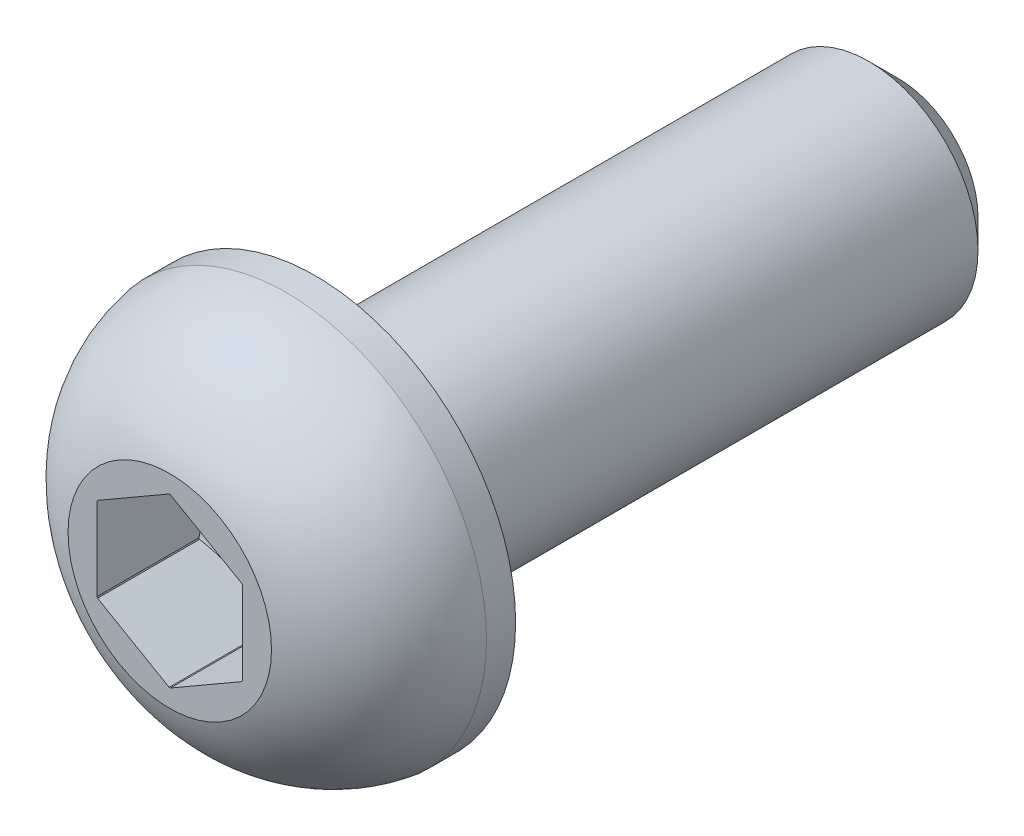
ISO-10303-21;
HEADER;
FILE_DESCRIPTION(('STEP AP214'),'2;1');
FILE_NAME('part.step','',(''),(''),'','','');
FILE_SCHEMA(('AUTOMOTIVE_DESIGN { 1 0 10303 214 1 1 1 1 }'));
ENDSEC;
DATA;
#1=APPLICATION_CONTEXT('core data for automotive mechanical design processes');
#2=APPLICATION_PROTOCOL_DEFINITION('international standard','automotive_design',2000,#1);
#3=PRODUCT_CONTEXT('',#1,'mechanical');
#4=PRODUCT('Part','Part','',(#3));
#5=PRODUCT_RELATED_PRODUCT_CATEGORY('part','',(#4));
#6=PRODUCT_DEFINITION_FORMATION('','',#4);
#7=PRODUCT_DEFINITION_CONTEXT('part definition',#1,'design');
#8=PRODUCT_DEFINITION('design','',#6,#7);
#9=PRODUCT_DEFINITION_SHAPE('','',#8);
#10=(LENGTH_UNIT() NAMED_UNIT(*) SI_UNIT(.MILLI.,.METRE.));
#11=(NAMED_UNIT(*) PLANE_ANGLE_UNIT() SI_UNIT($,.RADIAN.));
#12=(NAMED_UNIT(*) SI_UNIT($,.STERADIAN.) SOLID_ANGLE_UNIT());
#13=UNCERTAINTY_MEASURE_WITH_UNIT(LENGTH_MEASURE(1.E-05),#10,'distance_accuracy_value','');
#14=(GEOMETRIC_REPRESENTATION_CONTEXT(3) GLOBAL_UNCERTAINTY_ASSIGNED_CONTEXT((#13)) GLOBAL_UNIT_ASSIGNED_CONTEXT((#10,
#11,#12)) REPRESENTATION_CONTEXT('',''));
#15=CARTESIAN_POINT('',(0.,0.,0.));
#16=DIRECTION('',(0.,0.,1.));
#17=DIRECTION('',(1.,0.,0.));
#18=AXIS2_PLACEMENT_3D('',#15,#16,#17);
#19=CARTESIAN_POINT('',(0.906567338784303,1.5824292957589,0.));
#20=DIRECTION('',(0.,0.,-1.));
#21=DIRECTION('',(-1.,0.,0.));
#22=AXIS2_PLACEMENT_3D('',#19,#20,#21);
#23=PLANE('',#22);
#24=CARTESIAN_POINT('',(0.,0.,0.));
#25=DIRECTION('',(0.,0.,1.));
#26=DIRECTION('',(1.,0.,0.));
#27=AXIS2_PLACEMENT_3D('',#24,#25,#26);
#28=CIRCLE('',#27,0.110768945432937);
#29=CARTESIAN_POINT('',(0.110768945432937,0.,0.));
#30=VERTEX_POINT('',#29);
#31=EDGE_CURVE('E258',#30,#30,#28,.T.);
#32=ORIENTED_EDGE('',*,*,#31,.T.);
#33=EDGE_LOOP('',(#32));
#34=FACE_BOUND('',#33,.T.);
#35=ADVANCED_FACE('F16',(#34),#23,.F.);
#36=CARTESIAN_POINT('',(0.,0.,4.17099231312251));
#37=DIRECTION('',(0.,0.,1.));
#38=DIRECTION('',(1.,0.,0.));
#39=AXIS2_PLACEMENT_3D('',#36,#37,#38);
#40=CYLINDRICAL_SURFACE('',#39,1.15);
#41=CARTESIAN_POINT('',(0.,0.,2.));
#42=DIRECTION('',(0.,0.,1.));
#43=DIRECTION('',(1.,0.,0.));
#44=AXIS2_PLACEMENT_3D('',#41,#42,#43);
#45=CIRCLE('',#44,1.15);
#46=CARTESIAN_POINT('',(1.,-0.567890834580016,2.));
#47=VERTEX_POINT('',#46);
#48=CARTESIAN_POINT('',(0.991807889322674,-0.582079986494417,2.));
#49=VERTEX_POINT('',#48);
#50=EDGE_CURVE('E19',#47,#49,#45,.F.);
#51=ORIENTED_EDGE('',*,*,#50,.F.);
#52=DIRECTION('',(0.,0.,1.));
#53=VECTOR('',#52,1.);
#54=CARTESIAN_POINT('',(1.,-0.567890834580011,-0.844547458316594));
#55=LINE('',#54,#53);
#56=CARTESIAN_POINT('',(1.,-0.567890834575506,0.600000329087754));
#57=VERTEX_POINT('',#56);
#58=EDGE_CURVE('E178',#57,#47,#55,.T.);
#59=ORIENTED_EDGE('',*,*,#58,.F.);
#60=CARTESIAN_POINT('',(0.,0.,0.60000032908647));
#61=DIRECTION('',(0.,0.,1.));
#62=DIRECTION('',(1.,0.,0.));
#63=AXIS2_PLACEMENT_3D('',#60,#61,#62);
#64=CIRCLE('',#63,1.14999999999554);
#65=CARTESIAN_POINT('',(0.991807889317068,-0.582079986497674,0.600000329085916));
#66=VERTEX_POINT('',#65);
#67=EDGE_CURVE('E84',#57,#66,#64,.F.);
#68=ORIENTED_EDGE('',*,*,#67,.T.);
#69=DIRECTION('',(0.,0.,1.));
#70=VECTOR('',#69,1.);
#71=CARTESIAN_POINT('',(0.991807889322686,-0.58207998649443,-0.844547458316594));
#72=LINE('',#71,#70);
#73=EDGE_CURVE('E80',#49,#66,#72,.F.);
#74=ORIENTED_EDGE('',*,*,#73,.F.);
#75=EDGE_LOOP('',(#51,#59,#68,#74));
#76=FACE_BOUND('',#75,.T.);
#77=ADVANCED_FACE('F81',(#76),#40,.F.);
#78=CARTESIAN_POINT('',(0.,0.,4.17099231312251));
#79=DIRECTION('',(0.,0.,1.));
#80=DIRECTION('',(1.,0.,0.));
#81=AXIS2_PLACEMENT_3D('',#78,#79,#80);
#82=CYLINDRICAL_SURFACE('',#81,1.15);
#83=CARTESIAN_POINT('',(0.,0.,0.60000032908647));
#84=DIRECTION('',(0.,0.,1.));
#85=DIRECTION('',(1.,0.,0.));
#86=AXIS2_PLACEMENT_3D('',#83,#84,#85);
#87=CIRCLE('',#86,1.14999999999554);
#88=CARTESIAN_POINT('',(0.00819211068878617,-1.14997082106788,0.600000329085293));
#89=VERTEX_POINT('',#88);
#90=CARTESIAN_POINT('',(-0.00819211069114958,-1.14997082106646,0.600000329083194));
#91=VERTEX_POINT('',#90);
#92=EDGE_CURVE('E104',#89,#91,#87,.F.);
#93=ORIENTED_EDGE('',*,*,#92,.T.);
#94=DIRECTION('',(0.,0.,1.));
#95=VECTOR('',#94,1.);
#96=CARTESIAN_POINT('',(-0.00819211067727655,-1.14997082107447,-0.844547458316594));
#97=LINE('',#96,#95);
#98=CARTESIAN_POINT('',(-0.00819211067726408,-1.14997082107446,2.));
#99=VERTEX_POINT('',#98);
#100=EDGE_CURVE('E239',#99,#91,#97,.F.);
#101=ORIENTED_EDGE('',*,*,#100,.F.);
#102=CARTESIAN_POINT('',(0.,0.,2.));
#103=DIRECTION('',(0.,0.,1.));
#104=DIRECTION('',(1.,0.,0.));
#105=AXIS2_PLACEMENT_3D('',#102,#103,#104);
#106=CIRCLE('',#105,1.15);
#107=CARTESIAN_POINT('',(0.00819211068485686,-1.14997082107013,2.));
#108=VERTEX_POINT('',#107);
#109=EDGE_CURVE('E77',#108,#99,#106,.F.);
#110=ORIENTED_EDGE('',*,*,#109,.F.);
#111=DIRECTION('',(0.,0.,1.));
#112=VECTOR('',#111,1.);
#113=CARTESIAN_POINT('',(0.00819211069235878,-1.14997082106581,-0.844547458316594));
#114=LINE('',#113,#112);
#115=EDGE_CURVE('E94',#89,#108,#114,.T.);
#116=ORIENTED_EDGE('',*,*,#115,.F.);
#117=EDGE_LOOP('',(#93,#101,#110,#116));
#118=FACE_BOUND('',#117,.T.);
#119=ADVANCED_FACE('F280',(#118),#82,.F.);
#120=CARTESIAN_POINT('',(0.,0.,4.17099231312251));
#121=DIRECTION('',(0.,0.,1.));
#122=DIRECTION('',(1.,0.,0.));
#123=AXIS2_PLACEMENT_3D('',#120,#121,#122);
#124=CYLINDRICAL_SURFACE('',#123,1.15);
#125=CARTESIAN_POINT('',(0.,0.,0.60000032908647));
#126=DIRECTION('',(0.,0.,1.));
#127=DIRECTION('',(1.,0.,0.));
#128=AXIS2_PLACEMENT_3D('',#125,#126,#127);
#129=CIRCLE('',#128,1.14999999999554);
#130=CARTESIAN_POINT('',(-0.991807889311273,-0.582079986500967,0.600000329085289));
#131=VERTEX_POINT('',#130);
#132=CARTESIAN_POINT('',(-1.,-0.567890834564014,0.600000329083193));
#133=VERTEX_POINT('',#132);
#134=EDGE_CURVE('E266',#131,#133,#129,.F.);
#135=ORIENTED_EDGE('',*,*,#134,.T.);
#136=DIRECTION('',(0.,0.,-1.));
#137=VECTOR('',#136,1.);
#138=CARTESIAN_POINT('',(-1.,-0.567890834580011,-0.844547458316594));
#139=LINE('',#138,#137);
#140=CARTESIAN_POINT('',(-1.,-0.567890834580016,2.));
#141=VERTEX_POINT('',#140);
#142=EDGE_CURVE('E236',#141,#133,#139,.T.);
#143=ORIENTED_EDGE('',*,*,#142,.F.);
#144=CARTESIAN_POINT('',(0.,0.,2.));
#145=DIRECTION('',(0.,0.,1.));
#146=DIRECTION('',(1.,0.,0.));
#147=AXIS2_PLACEMENT_3D('',#144,#145,#146);
#148=CIRCLE('',#147,1.15);
#149=CARTESIAN_POINT('',(-0.991807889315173,-0.582079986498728,2.));
#150=VERTEX_POINT('',#149);
#151=EDGE_CURVE('E105',#150,#141,#148,.F.);
#152=ORIENTED_EDGE('',*,*,#151,.F.);
#153=DIRECTION('',(0.,0.,1.));
#154=VECTOR('',#153,1.);
#155=CARTESIAN_POINT('',(-0.991807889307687,-0.582079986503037,-0.844547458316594));
#156=LINE('',#155,#154);
#157=EDGE_CURVE('E242',#131,#150,#156,.T.);
#158=ORIENTED_EDGE('',*,*,#157,.F.);
#159=EDGE_LOOP('',(#135,#143,#152,#158));
#160=FACE_BOUND('',#159,.T.);
#161=ADVANCED_FACE('F369',(#160),#124,.F.);
#162=CARTESIAN_POINT('',(0.,0.,4.17099231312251));
#163=DIRECTION('',(0.,0.,1.));
#164=DIRECTION('',(1.,0.,0.));
#165=AXIS2_PLACEMENT_3D('',#162,#163,#164);
#166=CYLINDRICAL_SURFACE('',#165,1.15);
#167=CARTESIAN_POINT('',(0.,0.,0.60000032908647));
#168=DIRECTION('',(0.,0.,1.));
#169=DIRECTION('',(1.,0.,0.));
#170=AXIS2_PLACEMENT_3D('',#167,#168,#169);
#171=CIRCLE('',#170,1.14999999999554);
#172=CARTESIAN_POINT('',(-1.,0.567890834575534,0.600000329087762));
#173=VERTEX_POINT('',#172);
#174=CARTESIAN_POINT('',(-0.991807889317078,0.582079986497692,0.600000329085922));
#175=VERTEX_POINT('',#174);
#176=EDGE_CURVE('E260',#173,#175,#171,.F.);
#177=ORIENTED_EDGE('',*,*,#176,.T.);
#178=DIRECTION('',(0.,0.,1.));
#179=VECTOR('',#178,1.);
#180=CARTESIAN_POINT('',(-0.991807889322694,0.58207998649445,-0.844547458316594));
#181=LINE('',#180,#179);
#182=CARTESIAN_POINT('',(-0.991807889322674,0.582079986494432,2.));
#183=VERTEX_POINT('',#182);
#184=EDGE_CURVE('E230',#183,#175,#181,.F.);
#185=ORIENTED_EDGE('',*,*,#184,.F.);
#186=CARTESIAN_POINT('',(0.,0.,2.));
#187=DIRECTION('',(0.,0.,1.));
#188=DIRECTION('',(1.,0.,0.));
#189=AXIS2_PLACEMENT_3D('',#186,#187,#188);
#190=CIRCLE('',#189,1.15);
#191=CARTESIAN_POINT('',(-1.,0.567890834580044,2.));
#192=VERTEX_POINT('',#191);
#193=EDGE_CURVE('E263',#192,#183,#190,.F.);
#194=ORIENTED_EDGE('',*,*,#193,.F.);
#195=DIRECTION('',(0.,0.,-1.));
#196=VECTOR('',#195,1.);
#197=CARTESIAN_POINT('',(-1.,0.567890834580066,-0.844547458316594));
#198=LINE('',#197,#196);
#199=EDGE_CURVE('E233',#173,#192,#198,.F.);
#200=ORIENTED_EDGE('',*,*,#199,.F.);
#201=EDGE_LOOP('',(#177,#185,#194,#200));
#202=FACE_BOUND('',#201,.T.);
#203=ADVANCED_FACE('F145',(#202),#166,.F.);
#204=CARTESIAN_POINT('',(0.,0.,0.60000032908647));
#205=DIRECTION('',(0.,0.,1.));
#206=DIRECTION('',(1.,0.,0.));
#207=AXIS2_PLACEMENT_3D('',#204,#205,#206);
#208=CONICAL_SURFACE('',#207,1.14999999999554,1.04719755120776);
#209=ORIENTED_EDGE('',*,*,#31,.F.);
#210=EDGE_LOOP('',(#209));
#211=FACE_BOUND('',#210,.T.);
#212=CARTESIAN_POINT('',(1.00000000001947,0.567890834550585,0.600000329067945));
#213=CARTESIAN_POINT('',(1.0000000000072,0.52125847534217,0.586702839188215));
#214=CARTESIAN_POINT('',(1.00000000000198,0.474263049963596,0.574542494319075));
#215=CARTESIAN_POINT('',(0.999999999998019,0.379528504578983,0.553068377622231));
#216=CARTESIAN_POINT('',(0.999999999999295,0.331788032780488,0.543760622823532));
#217=CARTESIAN_POINT('',(1.00000000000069,0.236828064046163,0.528795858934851));
#218=CARTESIAN_POINT('',(1.00000000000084,0.189621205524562,0.523061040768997));
#219=CARTESIAN_POINT('',(0.999999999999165,0.0949426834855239,0.515363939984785));
#220=CARTESIAN_POINT('',(0.999999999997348,0.047471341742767,0.513397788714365));
#221=CARTESIAN_POINT('',(0.999999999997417,-0.0474713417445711,0.513397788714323));
#222=CARTESIAN_POINT('',(0.999999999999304,-0.0949426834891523,0.515363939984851));
#223=CARTESIAN_POINT('',(1.0000000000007,-0.18962120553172,0.523061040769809));
#224=CARTESIAN_POINT('',(1.0000000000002,-0.236828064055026,0.5287958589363));
#225=CARTESIAN_POINT('',(0.999999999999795,-0.33178803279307,0.543760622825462));
#226=CARTESIAN_POINT('',(0.999999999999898,-0.379528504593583,0.553068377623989));
#227=CARTESIAN_POINT('',(1.0000000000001,-0.474263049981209,0.574542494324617));
#228=CARTESIAN_POINT('',(1.00000000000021,-0.52125847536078,0.586702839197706));
#229=CARTESIAN_POINT('',(1.,-0.567890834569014,0.600000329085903));
#230=B_SPLINE_CURVE_WITH_KNOTS('',3,(#212,#213,#214,#215,#216,#217,#218,#219,#220,#221,#222,
#223,#224,#225,#226,#227,#228,#229),.UNSPECIFIED.,.F.,.F.,(4,2,2,2,2,2,2,2,4),(0.,
0.145515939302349,0.291336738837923,0.433859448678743,0.576235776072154,0.718612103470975,
0.861134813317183,1.00695561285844,1.15247155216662),.UNSPECIFIED.);
#231=CARTESIAN_POINT('',(1.,0.567890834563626,0.600000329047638));
#232=VERTEX_POINT('',#231);
#233=EDGE_CURVE('E171',#232,#57,#230,.T.);
#234=ORIENTED_EDGE('',*,*,#233,.F.);
#235=CARTESIAN_POINT('',(0.,0.,0.600000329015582));
#236=DIRECTION('',(0.,0.,1.));
#237=DIRECTION('',(1.,0.,0.));
#238=AXIS2_PLACEMENT_3D('',#235,#236,#237);
#239=CIRCLE('',#238,1.15);
#240=CARTESIAN_POINT('',(0.991807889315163,0.582079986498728,0.600000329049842));
#241=VERTEX_POINT('',#240);
#242=EDGE_CURVE('E255',#232,#241,#239,.T.);
#243=ORIENTED_EDGE('',*,*,#242,.T.);
#244=CARTESIAN_POINT('',(0.00819211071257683,1.14997082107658,0.600000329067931));
#245=CARTESIAN_POINT('',(0.0519987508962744,1.12467904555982,0.585572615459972));
#246=CARTESIAN_POINT('',(0.0961837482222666,1.0991688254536,0.572485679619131));
#247=CARTESIAN_POINT('',(0.185307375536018,1.04771327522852,0.549721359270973));
#248=CARTESIAN_POINT('',(0.23024750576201,1.02176707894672,0.540051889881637));
#249=CARTESIAN_POINT('',(0.319574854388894,0.970193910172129,0.525108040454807));
#250=CARTESIAN_POINT('',(0.363948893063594,0.944574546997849,0.519732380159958));
#251=CARTESIAN_POINT('',(0.452889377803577,0.893224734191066,0.513501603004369));
#252=CARTESIAN_POINT('',(0.497455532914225,0.867494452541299,0.51264112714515));
#253=CARTESIAN_POINT('',(0.579654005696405,0.820037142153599,0.51528956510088));
#254=CARTESIAN_POINT('',(0.617303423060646,0.798300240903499,0.518149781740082));
#255=CARTESIAN_POINT('',(0.692333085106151,0.754981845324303,0.526951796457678));
#256=CARTESIAN_POINT('',(0.729713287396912,0.733400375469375,0.532894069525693));
#257=CARTESIAN_POINT('',(0.804866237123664,0.690010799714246,0.547648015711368));
#258=CARTESIAN_POINT('',(0.84263005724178,0.668207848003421,0.556518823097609));
#259=CARTESIAN_POINT('',(0.917617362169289,0.624913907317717,0.576612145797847));
#260=CARTESIAN_POINT('',(0.954841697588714,0.603422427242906,0.587830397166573));
#261=CARTESIAN_POINT('',(0.99180788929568,0.582079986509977,0.600000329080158));
#262=B_SPLINE_CURVE_WITH_KNOTS('',3,(#244,#245,#246,#247,#248,#249,#250,#251,#252,#253,#254,
#255,#256,#257,#258,#259,#260,#261),.UNSPECIFIED.,.F.,.F.,(4,2,2,2,2,2,2,2,4),(0.,
0.157864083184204,0.316091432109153,0.470466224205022,0.624657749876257,0.755245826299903,
0.885854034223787,1.01927976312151,1.1524652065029),.UNSPECIFIED.);
#263=CARTESIAN_POINT('',(0.00819211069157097,1.14997082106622,0.60000032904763));
#264=VERTEX_POINT('',#263);
#265=EDGE_CURVE('E120',#264,#241,#262,.T.);
#266=ORIENTED_EDGE('',*,*,#265,.F.);
#267=CARTESIAN_POINT('',(0.,0.,0.600000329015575));
#268=DIRECTION('',(0.,0.,1.));
#269=DIRECTION('',(1.,0.,0.));
#270=AXIS2_PLACEMENT_3D('',#267,#268,#269);
#271=CIRCLE('',#270,1.15);
#272=CARTESIAN_POINT('',(-0.00819211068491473,1.14997082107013,0.600000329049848));
#273=VERTEX_POINT('',#272);
#274=EDGE_CURVE('E249',#264,#273,#271,.T.);
#275=ORIENTED_EDGE('',*,*,#274,.T.);
#276=CARTESIAN_POINT('',(-0.991807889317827,0.582079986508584,0.600000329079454));
#277=CARTESIAN_POINT('',(-0.948001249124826,0.607371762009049,0.585572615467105));
#278=CARTESIAN_POINT('',(-0.903816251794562,0.632881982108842,0.572485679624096));
#279=CARTESIAN_POINT('',(-0.814692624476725,0.684337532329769,0.549721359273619));
#280=CARTESIAN_POINT('',(-0.769752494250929,0.710283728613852,0.540051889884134));
#281=CARTESIAN_POINT('',(-0.680425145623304,0.761856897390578,0.525108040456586));
#282=CARTESIAN_POINT('',(-0.636051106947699,0.787476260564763,0.51973238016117));
#283=CARTESIAN_POINT('',(-0.547110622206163,0.838826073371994,0.513501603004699));
#284=CARTESIAN_POINT('',(-0.502544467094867,0.864556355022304,0.512641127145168));
#285=CARTESIAN_POINT('',(-0.420345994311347,0.91201366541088,0.515289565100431));
#286=CARTESIAN_POINT('',(-0.382696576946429,0.933750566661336,0.518149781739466));
#287=CARTESIAN_POINT('',(-0.307666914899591,0.977068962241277,0.526951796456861));
#288=CARTESIAN_POINT('',(-0.270286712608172,0.998650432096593,0.53289406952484));
#289=CARTESIAN_POINT('',(-0.195133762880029,1.04204000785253,0.547648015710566));
#290=CARTESIAN_POINT('',(-0.15736994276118,1.06384295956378,0.556518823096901));
#291=CARTESIAN_POINT('',(-0.0823826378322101,1.10713690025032,0.57661214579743));
#292=CARTESIAN_POINT('',(-0.0451583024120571,1.12862838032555,0.587830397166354));
#293=CARTESIAN_POINT('',(-0.0081921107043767,1.1499708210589,0.600000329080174));
#294=B_SPLINE_CURVE_WITH_KNOTS('',3,(#276,#277,#278,#279,#280,#281,#282,#283,#284,#285,#286,
#287,#288,#289,#290,#291,#292,#293),.UNSPECIFIED.,.F.,.F.,(4,2,2,2,2,2,2,2,4),(0.,
0.157864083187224,0.316091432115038,0.470466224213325,0.624657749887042,0.755245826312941,
0.885854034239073,1.01927976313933,1.15246520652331),.UNSPECIFIED.);
#295=EDGE_CURVE('E130',#175,#273,#294,.T.);
#296=ORIENTED_EDGE('',*,*,#295,.F.);
#297=ORIENTED_EDGE('',*,*,#176,.F.);
#298=CARTESIAN_POINT('',(-1.00000000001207,-0.567890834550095,0.600000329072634));
#299=CARTESIAN_POINT('',(-1.00000000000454,-0.52125847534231,0.586702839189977));
#300=CARTESIAN_POINT('',(-1.00000000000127,-0.474263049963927,0.574542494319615));
#301=CARTESIAN_POINT('',(-0.999999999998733,-0.379528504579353,0.553068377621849));
#302=CARTESIAN_POINT('',(-0.999999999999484,-0.331788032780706,0.543760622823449));
#303=CARTESIAN_POINT('',(-1.00000000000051,-0.236828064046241,0.528795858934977));
#304=CARTESIAN_POINT('',(-1.00000000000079,-0.189621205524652,0.523061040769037));
#305=CARTESIAN_POINT('',(-0.999999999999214,-0.0949426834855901,0.515363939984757));
#306=CARTESIAN_POINT('',(-0.999999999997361,-0.0474713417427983,0.513397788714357));
#307=CARTESIAN_POINT('',(-0.999999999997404,0.0474713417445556,0.513397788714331));
#308=CARTESIAN_POINT('',(-0.999999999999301,0.0949426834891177,0.515363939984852));
#309=CARTESIAN_POINT('',(-1.0000000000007,0.189621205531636,0.523061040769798));
#310=CARTESIAN_POINT('',(-1.0000000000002,0.236828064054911,0.528795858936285));
#311=CARTESIAN_POINT('',(-0.999999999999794,0.33178803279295,0.54376062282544));
#312=CARTESIAN_POINT('',(-0.999999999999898,0.379528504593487,0.553068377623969));
#313=CARTESIAN_POINT('',(-1.0000000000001,0.474263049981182,0.574542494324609));
#314=CARTESIAN_POINT('',(-1.00000000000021,0.521258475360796,0.586702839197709));
#315=CARTESIAN_POINT('',(-1.,0.567890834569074,0.60000032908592));
#316=B_SPLINE_CURVE_WITH_KNOTS('',3,(#298,#299,#300,#301,#302,#303,#304,#305,#306,#307,#308,
#309,#310,#311,#312,#313,#314,#315),.UNSPECIFIED.,.F.,.F.,(4,2,2,2,2,2,2,2,4),(0.,
0.145515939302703,0.291336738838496,0.433859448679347,0.576235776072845,0.718612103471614,
0.861134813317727,1.00695561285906,1.15247155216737),.UNSPECIFIED.);
#317=EDGE_CURVE('E151',#133,#173,#316,.T.);
#318=ORIENTED_EDGE('',*,*,#317,.F.);
#319=ORIENTED_EDGE('',*,*,#134,.F.);
#320=CARTESIAN_POINT('',(-0.00819211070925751,-1.14997082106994,0.600000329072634));
#321=CARTESIAN_POINT('',(-0.051998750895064,-1.12467904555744,0.585572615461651));
#322=CARTESIAN_POINT('',(-0.0961837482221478,-1.09916882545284,0.57248567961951));
#323=CARTESIAN_POINT('',(-0.18530737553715,-1.04771327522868,0.549721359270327));
#324=CARTESIAN_POINT('',(-0.230247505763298,-1.02176707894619,0.540051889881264));
#325=CARTESIAN_POINT('',(-0.319574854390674,-0.970193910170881,0.525108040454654));
#326=CARTESIAN_POINT('',(-0.363948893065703,-0.944574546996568,0.519732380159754));
#327=CARTESIAN_POINT('',(-0.452889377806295,-0.893224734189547,0.513501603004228));
#328=CARTESIAN_POINT('',(-0.497455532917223,-0.867494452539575,0.512641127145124));
#329=CARTESIAN_POINT('',(-0.579654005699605,-0.820037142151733,0.515289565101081));
#330=CARTESIAN_POINT('',(-0.617303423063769,-0.798300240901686,0.518149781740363));
#331=CARTESIAN_POINT('',(-0.69233308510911,-0.754981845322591,0.526951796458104));
#332=CARTESIAN_POINT('',(-0.729713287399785,-0.733400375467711,0.532894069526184));
#333=CARTESIAN_POINT('',(-0.804866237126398,-0.690010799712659,0.547648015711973));
#334=CARTESIAN_POINT('',(-0.84263005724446,-0.668207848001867,0.556518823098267));
#335=CARTESIAN_POINT('',(-0.917617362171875,-0.624913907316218,0.576612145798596));
#336=CARTESIAN_POINT('',(-0.954841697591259,-0.603422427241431,0.587830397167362));
#337=CARTESIAN_POINT('',(-0.991807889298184,-0.582079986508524,0.60000032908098));
#338=B_SPLINE_CURVE_WITH_KNOTS('',3,(#320,#321,#322,#323,#324,#325,#326,#327,#328,#329,#330,
#331,#332,#333,#334,#335,#336,#337),.UNSPECIFIED.,.F.,.F.,(4,2,2,2,2,2,2,2,4),(0.,
0.157864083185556,0.316091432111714,0.470466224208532,0.624657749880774,0.755245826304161,
0.88585403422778,1.01927976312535,1.15246520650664),.UNSPECIFIED.);
#339=EDGE_CURVE('E159',#91,#131,#338,.T.);
#340=ORIENTED_EDGE('',*,*,#339,.F.);
#341=ORIENTED_EDGE('',*,*,#92,.F.);
#342=CARTESIAN_POINT('',(0.991807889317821,-0.582079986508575,0.600000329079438));
#343=CARTESIAN_POINT('',(0.948001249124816,-0.607371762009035,0.585572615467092));
#344=CARTESIAN_POINT('',(0.903816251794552,-0.632881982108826,0.572485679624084));
#345=CARTESIAN_POINT('',(0.814692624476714,-0.684337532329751,0.549721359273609));
#346=CARTESIAN_POINT('',(0.769752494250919,-0.710283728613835,0.540051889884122));
#347=CARTESIAN_POINT('',(0.680425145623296,-0.76185689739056,0.525108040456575));
#348=CARTESIAN_POINT('',(0.636051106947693,-0.787476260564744,0.519732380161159));
#349=CARTESIAN_POINT('',(0.547110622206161,-0.838826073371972,0.513501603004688));
#350=CARTESIAN_POINT('',(0.502544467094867,-0.864556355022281,0.512641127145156));
#351=CARTESIAN_POINT('',(0.420345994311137,-0.912013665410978,0.515289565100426));
#352=CARTESIAN_POINT('',(0.382696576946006,-0.933750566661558,0.518149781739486));
#353=CARTESIAN_POINT('',(0.307666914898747,-0.977068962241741,0.526951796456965));
#354=CARTESIAN_POINT('',(0.27028671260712,-0.998650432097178,0.532894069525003));
#355=CARTESIAN_POINT('',(0.195133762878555,-1.04204000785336,0.547648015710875));
#356=CARTESIAN_POINT('',(0.157369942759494,-1.06384295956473,0.556518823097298));
#357=CARTESIAN_POINT('',(0.082382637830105,-1.10713690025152,0.576612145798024));
#358=CARTESIAN_POINT('',(0.0451583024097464,-1.12862838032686,0.587830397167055));
#359=CARTESIAN_POINT('',(0.00819211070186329,-1.14997082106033,0.600000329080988));
#360=B_SPLINE_CURVE_WITH_KNOTS('',3,(#342,#343,#344,#345,#346,#347,#348,#349,#350,#351,#352,
#353,#354,#355,#356,#357,#358,#359),.UNSPECIFIED.,.F.,.F.,(4,2,2,2,2,2,2,2,4),(0.,
0.157864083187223,0.316091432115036,0.470466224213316,0.624657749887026,0.755245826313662,
0.885854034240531,1.01927976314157,1.15246520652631),.UNSPECIFIED.);
#361=EDGE_CURVE('E88',#66,#89,#360,.T.);
#362=ORIENTED_EDGE('',*,*,#361,.F.);
#363=ORIENTED_EDGE('',*,*,#67,.F.);
#364=EDGE_LOOP('',(#234,#243,#266,#275,#296,#297,#318,#319,#340,#341,#362,#363));
#365=FACE_BOUND('',#364,.T.);
#366=ADVANCED_FACE('F139',(#211,#365),#208,.F.);
#367=CARTESIAN_POINT('',(0.,0.,4.17099231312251));
#368=DIRECTION('',(0.,0.,1.));
#369=DIRECTION('',(1.,0.,0.));
#370=AXIS2_PLACEMENT_3D('',#367,#368,#369);
#371=CYLINDRICAL_SURFACE('',#370,1.15);
#372=CARTESIAN_POINT('',(0.,0.,2.));
#373=DIRECTION('',(0.,0.,1.));
#374=DIRECTION('',(1.,0.,0.));
#375=AXIS2_PLACEMENT_3D('',#372,#373,#374);
#376=CIRCLE('',#375,1.15);
#377=CARTESIAN_POINT('',(0.991807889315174,0.582079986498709,2.));
#378=VERTEX_POINT('',#377);
#379=CARTESIAN_POINT('',(1.,0.56789083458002,2.));
#380=VERTEX_POINT('',#379);
#381=EDGE_CURVE('E252',#378,#380,#376,.F.);
#382=ORIENTED_EDGE('',*,*,#381,.F.);
#383=DIRECTION('',(0.,0.,1.));
#384=VECTOR('',#383,1.);
#385=CARTESIAN_POINT('',(0.991807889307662,0.582079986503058,-0.844547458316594));
#386=LINE('',#385,#384);
#387=EDGE_CURVE('E128',#241,#378,#386,.T.);
#388=ORIENTED_EDGE('',*,*,#387,.F.);
#389=ORIENTED_EDGE('',*,*,#242,.F.);
#390=DIRECTION('',(0.,0.,1.));
#391=VECTOR('',#390,1.);
#392=CARTESIAN_POINT('',(1.,0.567890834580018,-0.844547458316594));
#393=LINE('',#392,#391);
#394=EDGE_CURVE('E89',#380,#232,#393,.F.);
#395=ORIENTED_EDGE('',*,*,#394,.F.);
#396=EDGE_LOOP('',(#382,#388,#389,#395));
#397=FACE_BOUND('',#396,.T.);
#398=ADVANCED_FACE('F144',(#397),#371,.F.);
#399=CARTESIAN_POINT('',(0.,0.,4.17099231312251));
#400=DIRECTION('',(0.,0.,1.));
#401=DIRECTION('',(1.,0.,0.));
#402=AXIS2_PLACEMENT_3D('',#399,#400,#401);
#403=CYLINDRICAL_SURFACE('',#402,1.15);
#404=CARTESIAN_POINT('',(0.,0.,2.));
#405=DIRECTION('',(0.,0.,1.));
#406=DIRECTION('',(1.,0.,0.));
#407=AXIS2_PLACEMENT_3D('',#404,#405,#406);
#408=CIRCLE('',#407,1.15);
#409=CARTESIAN_POINT('',(-0.00819211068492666,1.14997082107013,2.));
#410=VERTEX_POINT('',#409);
#411=CARTESIAN_POINT('',(0.00819211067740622,1.14997082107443,2.));
#412=VERTEX_POINT('',#411);
#413=EDGE_CURVE('E34',#410,#412,#408,.F.);
#414=ORIENTED_EDGE('',*,*,#413,.F.);
#415=DIRECTION('',(0.,0.,1.));
#416=VECTOR('',#415,1.);
#417=CARTESIAN_POINT('',(-0.00819211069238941,1.14997082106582,-0.844547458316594));
#418=LINE('',#417,#416);
#419=EDGE_CURVE('E129',#273,#410,#418,.T.);
#420=ORIENTED_EDGE('',*,*,#419,.F.);
#421=ORIENTED_EDGE('',*,*,#274,.F.);
#422=DIRECTION('',(0.,0.,1.));
#423=VECTOR('',#422,1.);
#424=CARTESIAN_POINT('',(0.00819211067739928,1.1499708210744,-0.844547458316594));
#425=LINE('',#424,#423);
#426=EDGE_CURVE('E100',#412,#264,#425,.F.);
#427=ORIENTED_EDGE('',*,*,#426,.F.);
#428=EDGE_LOOP('',(#414,#420,#421,#427));
#429=FACE_BOUND('',#428,.T.);
#430=ADVANCED_FACE('F183',(#429),#403,.F.);
#431=CARTESIAN_POINT('',(1.,-0.577350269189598,-0.844547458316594));
#432=DIRECTION('',(-1.,0.,0.));
#433=DIRECTION('',(0.,0.,1.));
#434=AXIS2_PLACEMENT_3D('',#431,#432,#433);
#435=PLANE('',#434);
#436=DIRECTION('',(0.,1.,0.));
#437=VECTOR('',#436,1.);
#438=CARTESIAN_POINT('',(1.,-0.6783928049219,2.));
#439=LINE('',#438,#437);
#440=EDGE_CURVE('E76',#380,#47,#439,.F.);
#441=ORIENTED_EDGE('',*,*,#440,.F.);
#442=ORIENTED_EDGE('',*,*,#394,.T.);
#443=ORIENTED_EDGE('',*,*,#233,.T.);
#444=ORIENTED_EDGE('',*,*,#58,.T.);
#445=EDGE_LOOP('',(#441,#442,#443,#444));
#446=FACE_BOUND('',#445,.T.);
#447=ADVANCED_FACE('F180',(#446),#435,.T.);
#448=CARTESIAN_POINT('',(0.732050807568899,-0.732050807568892,-0.844547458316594));
#449=DIRECTION('',(-0.5,0.866025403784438,0.));
#450=DIRECTION('',(-0.866025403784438,-0.5,0.));
#451=AXIS2_PLACEMENT_3D('',#448,#449,#450);
#452=PLANE('',#451);
#453=ORIENTED_EDGE('',*,*,#115,.T.);
#454=DIRECTION('',(-0.866025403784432,-0.500000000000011,0.));
#455=VECTOR('',#454,1.);
#456=CARTESIAN_POINT('',(0.991807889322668,-0.582079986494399,2.));
#457=LINE('',#456,#455);
#458=EDGE_CURVE('E74',#49,#108,#457,.T.);
#459=ORIENTED_EDGE('',*,*,#458,.F.);
#460=ORIENTED_EDGE('',*,*,#73,.T.);
#461=ORIENTED_EDGE('',*,*,#361,.T.);
#462=EDGE_LOOP('',(#453,#459,#460,#461));
#463=FACE_BOUND('',#462,.T.);
#464=ADVANCED_FACE('F92',(#463),#452,.T.);
#465=CARTESIAN_POINT('',(-1.,-0.577350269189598,-0.844547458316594));
#466=DIRECTION('',(0.5,0.866025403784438,0.));
#467=DIRECTION('',(-0.866025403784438,0.5,0.));
#468=AXIS2_PLACEMENT_3D('',#465,#466,#467);
#469=PLANE('',#468);
#470=DIRECTION('',(-0.866025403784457,0.499999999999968,0.));
#471=VECTOR('',#470,1.);
#472=CARTESIAN_POINT('',(-0.00819211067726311,-1.14997082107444,2.));
#473=LINE('',#472,#471);
#474=EDGE_CURVE('E95',#99,#150,#473,.T.);
#475=ORIENTED_EDGE('',*,*,#474,.F.);
#476=ORIENTED_EDGE('',*,*,#100,.T.);
#477=ORIENTED_EDGE('',*,*,#339,.T.);
#478=ORIENTED_EDGE('',*,*,#157,.T.);
#479=EDGE_LOOP('',(#475,#476,#477,#478));
#480=FACE_BOUND('',#479,.T.);
#481=ADVANCED_FACE('F290',(#480),#469,.T.);
#482=CARTESIAN_POINT('',(-1.,0.577350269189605,-0.844547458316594));
#483=DIRECTION('',(1.,0.,0.));
#484=DIRECTION('',(0.,0.,-1.));
#485=AXIS2_PLACEMENT_3D('',#482,#483,#484);
#486=PLANE('',#485);
#487=ORIENTED_EDGE('',*,*,#317,.T.);
#488=ORIENTED_EDGE('',*,*,#199,.T.);
#489=DIRECTION('',(0.,1.,0.));
#490=VECTOR('',#489,1.);
#491=CARTESIAN_POINT('',(-1.,-0.6783928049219,2.));
#492=LINE('',#491,#490);
#493=EDGE_CURVE('E98',#141,#192,#492,.T.);
#494=ORIENTED_EDGE('',*,*,#493,.F.);
#495=ORIENTED_EDGE('',*,*,#142,.T.);
#496=EDGE_LOOP('',(#487,#488,#494,#495));
#497=FACE_BOUND('',#496,.T.);
#498=ADVANCED_FACE('F328',(#497),#486,.T.);
#499=CARTESIAN_POINT('',(0.,1.1547005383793,-0.844547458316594));
#500=DIRECTION('',(0.5,-0.866025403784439,0.));
#501=DIRECTION('',(0.866025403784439,0.5,0.));
#502=AXIS2_PLACEMENT_3D('',#499,#500,#501);
#503=PLANE('',#502);
#504=ORIENTED_EDGE('',*,*,#295,.T.);
#505=ORIENTED_EDGE('',*,*,#419,.T.);
#506=DIRECTION('',(0.866025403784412,0.500000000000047,0.));
#507=VECTOR('',#506,1.);
#508=CARTESIAN_POINT('',(-0.991807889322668,0.582079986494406,2.));
#509=LINE('',#508,#507);
#510=EDGE_CURVE('E254',#183,#410,#509,.T.);
#511=ORIENTED_EDGE('',*,*,#510,.F.);
#512=ORIENTED_EDGE('',*,*,#184,.T.);
#513=EDGE_LOOP('',(#504,#505,#511,#512));
#514=FACE_BOUND('',#513,.T.);
#515=ADVANCED_FACE('F322',(#514),#503,.T.);
#516=CARTESIAN_POINT('',(1.,0.577350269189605,-0.844547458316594));
#517=DIRECTION('',(-0.5,-0.866025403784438,0.));
#518=DIRECTION('',(0.866025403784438,-0.5,0.));
#519=AXIS2_PLACEMENT_3D('',#516,#517,#518);
#520=PLANE('',#519);
#521=DIRECTION('',(0.866025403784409,-0.500000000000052,0.));
#522=VECTOR('',#521,1.);
#523=CARTESIAN_POINT('',(0.0081921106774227,1.14997082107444,2.));
#524=LINE('',#523,#522);
#525=EDGE_CURVE('E119',#412,#378,#524,.T.);
#526=ORIENTED_EDGE('',*,*,#525,.F.);
#527=ORIENTED_EDGE('',*,*,#426,.T.);
#528=ORIENTED_EDGE('',*,*,#265,.T.);
#529=ORIENTED_EDGE('',*,*,#387,.T.);
#530=EDGE_LOOP('',(#526,#527,#528,#529));
#531=FACE_BOUND('',#530,.T.);
#532=ADVANCED_FACE('F136',(#531),#520,.T.);
#533=CARTESIAN_POINT('',(0.166657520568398,-0.6783928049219,2.));
#534=DIRECTION('',(0.,0.,1.));
#535=DIRECTION('',(1.,0.,0.));
#536=AXIS2_PLACEMENT_3D('',#533,#534,#535);
#537=PLANE('',#536);
#538=CARTESIAN_POINT('',(0.,0.,2.));
#539=DIRECTION('',(0.,0.,-1.));
#540=DIRECTION('',(-1.,0.,0.));
#541=AXIS2_PLACEMENT_3D('',#538,#539,#540);
#542=CIRCLE('',#541,1.39712780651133);
#543=CARTESIAN_POINT('',(-1.39712780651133,0.,2.));
#544=VERTEX_POINT('',#543);
#545=EDGE_CURVE('E116',#544,#544,#542,.T.);
#546=ORIENTED_EDGE('',*,*,#545,.F.);
#547=EDGE_LOOP('',(#546));
#548=FACE_BOUND('',#547,.T.);
#549=ORIENTED_EDGE('',*,*,#413,.T.);
#550=ORIENTED_EDGE('',*,*,#525,.T.);
#551=ORIENTED_EDGE('',*,*,#381,.T.);
#552=ORIENTED_EDGE('',*,*,#440,.T.);
#553=ORIENTED_EDGE('',*,*,#50,.T.);
#554=ORIENTED_EDGE('',*,*,#458,.T.);
#555=ORIENTED_EDGE('',*,*,#109,.T.);
#556=ORIENTED_EDGE('',*,*,#474,.T.);
#557=ORIENTED_EDGE('',*,*,#151,.T.);
#558=ORIENTED_EDGE('',*,*,#493,.T.);
#559=ORIENTED_EDGE('',*,*,#193,.T.);
#560=ORIENTED_EDGE('',*,*,#510,.T.);
#561=EDGE_LOOP('',(#549,#550,#551,#552,#553,#554,#555,#556,#557,#558,#559,#560));
#562=FACE_BOUND('',#561,.T.);
#563=ADVANCED_FACE('F72',(#548,#562),#537,.T.);
#564=CARTESIAN_POINT('',(0.184327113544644,-0.750318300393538,0.100000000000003));
#565=DIRECTION('',(-0.971124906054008,-0.238571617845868,0.));
#566=DIRECTION('',(0.238571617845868,-0.971124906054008,0.));
#567=AXIS2_PLACEMENT_3D('',#564,#565,#566);
#568=CIRCLE('',#567,2.);
#569=TRIMMED_CURVE('',#568,(PARAMETER_VALUE(-1.96742832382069)),
(PARAMETER_VALUE(1.96742832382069)),.T.,.PARAMETER.);
#570=CARTESIAN_POINT('',(0.,0.,0.100000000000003));
#571=DIRECTION('',(0.,0.,-1.));
#572=AXIS1_PLACEMENT('',#570,#571);
#573=SURFACE_OF_REVOLUTION('',#569,#572);
#574=ORIENTED_EDGE('',*,*,#545,.T.);
#575=EDGE_LOOP('',(#574));
#576=FACE_BOUND('',#575,.T.);
#577=CARTESIAN_POINT('',(0.,0.,0.400000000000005));
#578=DIRECTION('',(0.,0.,1.));
#579=DIRECTION('',(1.,0.,0.));
#580=AXIS2_PLACEMENT_3D('',#577,#578,#579);
#581=CIRCLE('',#580,2.75);
#582=CARTESIAN_POINT('',(2.75,0.,0.400000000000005));
#583=VERTEX_POINT('',#582);
#584=EDGE_CURVE('E115',#583,#583,#581,.F.);
#585=ORIENTED_EDGE('',*,*,#584,.F.);
#586=EDGE_LOOP('',(#585));
#587=FACE_BOUND('',#586,.T.);
#588=ADVANCED_FACE('F216',(#576,#587),#573,.F.);
#589=CARTESIAN_POINT('',(0.,0.,0.200000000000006));
#590=DIRECTION('',(0.,0.,1.));
#591=DIRECTION('',(1.,0.,0.));
#592=AXIS2_PLACEMENT_3D('',#589,#590,#591);
#593=CYLINDRICAL_SURFACE('',#592,2.75);
#594=ORIENTED_EDGE('',*,*,#584,.T.);
#595=EDGE_LOOP('',(#594));
#596=FACE_BOUND('',#595,.T.);
#597=CARTESIAN_POINT('',(0.,0.,0.));
#598=DIRECTION('',(0.,0.,1.));
#599=DIRECTION('',(1.,0.,0.));
#600=AXIS2_PLACEMENT_3D('',#597,#598,#599);
#601=CIRCLE('',#600,2.75);
#602=CARTESIAN_POINT('',(2.75,0.,0.));
#603=VERTEX_POINT('',#602);
#604=EDGE_CURVE('E112',#603,#603,#601,.F.);
#605=ORIENTED_EDGE('',*,*,#604,.F.);
#606=EDGE_LOOP('',(#605));
#607=FACE_BOUND('',#606,.T.);
#608=ADVANCED_FACE('F212',(#596,#607),#593,.T.);
#609=CARTESIAN_POINT('',(1.0924914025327,-9.64850156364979,-8.));
#610=DIRECTION('',(0.,0.,1.));
#611=DIRECTION('',(1.,0.,0.));
#612=AXIS2_PLACEMENT_3D('',#609,#610,#611);
#613=PLANE('',#612);
#614=CARTESIAN_POINT('',(0.,0.,-7.99999999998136));
#615=DIRECTION('',(0.,0.,1.));
#616=DIRECTION('',(1.,0.,0.));
#617=AXIS2_PLACEMENT_3D('',#614,#615,#616);
#618=CIRCLE('',#617,1.10000000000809);
#619=CARTESIAN_POINT('',(1.10000000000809,0.,-7.99999999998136));
#620=VERTEX_POINT('',#619);
#621=EDGE_CURVE('E109',#620,#620,#618,.T.);
#622=ORIENTED_EDGE('',*,*,#621,.F.);
#623=EDGE_LOOP('',(#622));
#624=FACE_BOUND('',#623,.T.);
#625=ADVANCED_FACE('F208',(#624),#613,.F.);
#626=CARTESIAN_POINT('',(0.178928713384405,-0.7283436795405,0.));
#627=DIRECTION('',(0.,0.,-1.));
#628=DIRECTION('',(-1.,0.,0.));
#629=AXIS2_PLACEMENT_3D('',#626,#627,#628);
#630=PLANE('',#629);
#631=ORIENTED_EDGE('',*,*,#604,.T.);
#632=EDGE_LOOP('',(#631));
#633=FACE_BOUND('',#632,.T.);
#634=CARTESIAN_POINT('',(0.,0.,0.));
#635=DIRECTION('',(0.,0.,-1.));
#636=DIRECTION('',(0.,1.,0.));
#637=AXIS2_PLACEMENT_3D('',#634,#635,#636);
#638=CIRCLE('',#637,1.5);
#639=CARTESIAN_POINT('',(0.,1.5,0.));
#640=VERTEX_POINT('',#639);
#641=EDGE_CURVE('E25',#640,#640,#638,.T.);
#642=ORIENTED_EDGE('',*,*,#641,.F.);
#643=EDGE_LOOP('',(#642));
#644=FACE_BOUND('',#643,.T.);
#645=ADVANCED_FACE('F201',(#633,#644),#630,.T.);
#646=CARTESIAN_POINT('',(0.,0.,-7.60000000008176));
#647=DIRECTION('',(0.,0.,1.));
#648=DIRECTION('',(1.,0.,0.));
#649=AXIS2_PLACEMENT_3D('',#646,#647,#648);
#650=CONICAL_SURFACE('',#649,1.49999999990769,0.785398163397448);
#651=CARTESIAN_POINT('',(0.,0.,-7.59999999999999));
#652=DIRECTION('',(0.,0.,-1.));
#653=DIRECTION('',(0.,1.,0.));
#654=AXIS2_PLACEMENT_3D('',#651,#652,#653);
#655=CIRCLE('',#654,1.5);
#656=CARTESIAN_POINT('',(0.,1.5,-7.59999999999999));
#657=VERTEX_POINT('',#656);
#658=EDGE_CURVE('E10',#657,#657,#655,.F.);
#659=ORIENTED_EDGE('',*,*,#658,.F.);
#660=EDGE_LOOP('',(#659));
#661=FACE_BOUND('',#660,.T.);
#662=ORIENTED_EDGE('',*,*,#621,.T.);
#663=EDGE_LOOP('',(#662));
#664=FACE_BOUND('',#663,.T.);
#665=ADVANCED_FACE('F195',(#661,#664),#650,.T.);
#666=CARTESIAN_POINT('',(0.,0.,-5.99999999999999));
#667=DIRECTION('',(0.,0.,-1.));
#668=DIRECTION('',(0.,1.,0.));
#669=AXIS2_PLACEMENT_3D('',#666,#667,#668);
#670=CYLINDRICAL_SURFACE('',#669,1.5);
#671=ORIENTED_EDGE('',*,*,#658,.T.);
#672=EDGE_LOOP('',(#671));
#673=FACE_BOUND('',#672,.T.);
#674=ORIENTED_EDGE('',*,*,#641,.T.);
#675=EDGE_LOOP('',(#674));
#676=FACE_BOUND('',#675,.T.);
#677=ADVANCED_FACE('F193',(#673,#676),#670,.T.);
#678=CLOSED_SHELL('',(#35,#77,#119,#161,#203,#366,#398,#430,#447,#464,#481,#498,#515,#532,#563,
#588,#608,#625,#645,#665,#677));
#679=MANIFOLD_SOLID_BREP('B1',#678);
#680=ADVANCED_BREP_SHAPE_REPRESENTATION('',(#18,#679),#14);
#681=SHAPE_DEFINITION_REPRESENTATION(#9,#680);
ENDSEC;
END-ISO-10303-21;
